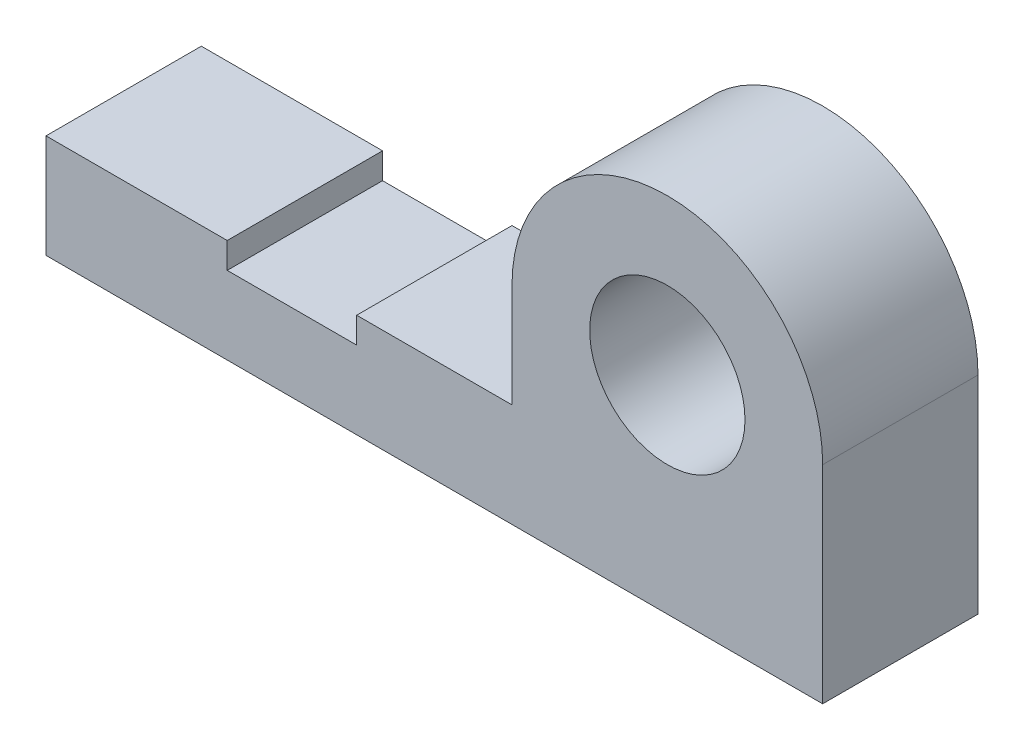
ISO-10303-21;
HEADER;
FILE_DESCRIPTION(('STEP AP214'),'2;1');
FILE_NAME('part.step','',(''),(''),'','','');
FILE_SCHEMA(('AUTOMOTIVE_DESIGN { 1 0 10303 214 1 1 1 1 }'));
ENDSEC;
DATA;
#1=APPLICATION_CONTEXT('core data for automotive mechanical design processes');
#2=APPLICATION_PROTOCOL_DEFINITION('international standard','automotive_design',2000,#1);
#3=PRODUCT_CONTEXT('',#1,'mechanical');
#4=PRODUCT('Part','Part','',(#3));
#5=PRODUCT_RELATED_PRODUCT_CATEGORY('part','',(#4));
#6=PRODUCT_DEFINITION_FORMATION('','',#4);
#7=PRODUCT_DEFINITION_CONTEXT('part definition',#1,'design');
#8=PRODUCT_DEFINITION('design','',#6,#7);
#9=PRODUCT_DEFINITION_SHAPE('','',#8);
#10=(LENGTH_UNIT() NAMED_UNIT(*) SI_UNIT(.MILLI.,.METRE.));
#11=(NAMED_UNIT(*) PLANE_ANGLE_UNIT() SI_UNIT($,.RADIAN.));
#12=(NAMED_UNIT(*) SI_UNIT($,.STERADIAN.) SOLID_ANGLE_UNIT());
#13=UNCERTAINTY_MEASURE_WITH_UNIT(LENGTH_MEASURE(1.E-05),#10,'distance_accuracy_value','');
#14=(GEOMETRIC_REPRESENTATION_CONTEXT(3) GLOBAL_UNCERTAINTY_ASSIGNED_CONTEXT((#13)) GLOBAL_UNIT_ASSIGNED_CONTEXT((#10,
#11,#12)) REPRESENTATION_CONTEXT('',''));
#15=CARTESIAN_POINT('',(0.,0.,0.));
#16=DIRECTION('',(0.,0.,1.));
#17=DIRECTION('',(1.,0.,0.));
#18=AXIS2_PLACEMENT_3D('',#15,#16,#17);
#19=CARTESIAN_POINT('',(120.,40.,30.));
#20=DIRECTION('',(0.,0.,1.));
#21=DIRECTION('',(1.,0.,0.));
#22=AXIS2_PLACEMENT_3D('',#19,#20,#21);
#23=PLANE('',#22);
#24=DIRECTION('',(0.,1.,0.));
#25=VECTOR('',#24,1.);
#26=CARTESIAN_POINT('',(150.,0.,30.));
#27=LINE('',#26,#25);
#28=CARTESIAN_POINT('',(150.,0.,30.));
#29=VERTEX_POINT('',#28);
#30=CARTESIAN_POINT('',(150.,40.,30.));
#31=VERTEX_POINT('',#30);
#32=EDGE_CURVE('E200',#29,#31,#27,.T.);
#33=ORIENTED_EDGE('',*,*,#32,.T.);
#34=CARTESIAN_POINT('',(120.,40.,30.));
#35=DIRECTION('',(0.,0.,1.));
#36=DIRECTION('',(1.,0.,0.));
#37=AXIS2_PLACEMENT_3D('',#34,#35,#36);
#38=CIRCLE('',#37,30.);
#39=CARTESIAN_POINT('',(90.,40.,30.));
#40=VERTEX_POINT('',#39);
#41=EDGE_CURVE('E138',#31,#40,#38,.T.);
#42=ORIENTED_EDGE('',*,*,#41,.T.);
#43=DIRECTION('',(0.,-1.,0.));
#44=VECTOR('',#43,1.);
#45=CARTESIAN_POINT('',(90.,40.,30.));
#46=LINE('',#45,#44);
#47=CARTESIAN_POINT('',(90.,20.,30.));
#48=VERTEX_POINT('',#47);
#49=EDGE_CURVE('E221',#40,#48,#46,.T.);
#50=ORIENTED_EDGE('',*,*,#49,.T.);
#51=DIRECTION('',(-1.,0.,0.));
#52=VECTOR('',#51,1.);
#53=CARTESIAN_POINT('',(90.,20.,30.));
#54=LINE('',#53,#52);
#55=CARTESIAN_POINT('',(60.,20.,30.));
#56=VERTEX_POINT('',#55);
#57=EDGE_CURVE('E240',#48,#56,#54,.T.);
#58=ORIENTED_EDGE('',*,*,#57,.T.);
#59=DIRECTION('',(0.,-1.,0.));
#60=VECTOR('',#59,1.);
#61=CARTESIAN_POINT('',(60.,20.,30.));
#62=LINE('',#61,#60);
#63=CARTESIAN_POINT('',(60.,15.,30.));
#64=VERTEX_POINT('',#63);
#65=EDGE_CURVE('E237',#56,#64,#62,.T.);
#66=ORIENTED_EDGE('',*,*,#65,.T.);
#67=DIRECTION('',(-1.,0.,0.));
#68=VECTOR('',#67,1.);
#69=CARTESIAN_POINT('',(60.,15.,30.));
#70=LINE('',#69,#68);
#71=CARTESIAN_POINT('',(35.,15.,30.));
#72=VERTEX_POINT('',#71);
#73=EDGE_CURVE('E239',#64,#72,#70,.T.);
#74=ORIENTED_EDGE('',*,*,#73,.T.);
#75=DIRECTION('',(0.,1.,0.));
#76=VECTOR('',#75,1.);
#77=CARTESIAN_POINT('',(35.,15.,30.));
#78=LINE('',#77,#76);
#79=CARTESIAN_POINT('',(35.,20.,30.));
#80=VERTEX_POINT('',#79);
#81=EDGE_CURVE('E163',#72,#80,#78,.T.);
#82=ORIENTED_EDGE('',*,*,#81,.T.);
#83=DIRECTION('',(-1.,0.,0.));
#84=VECTOR('',#83,1.);
#85=CARTESIAN_POINT('',(35.,20.,30.));
#86=LINE('',#85,#84);
#87=CARTESIAN_POINT('',(0.,20.,30.));
#88=VERTEX_POINT('',#87);
#89=EDGE_CURVE('E157',#80,#88,#86,.T.);
#90=ORIENTED_EDGE('',*,*,#89,.T.);
#91=DIRECTION('',(0.,-1.,0.));
#92=VECTOR('',#91,1.);
#93=CARTESIAN_POINT('',(0.,20.,30.));
#94=LINE('',#93,#92);
#95=CARTESIAN_POINT('',(0.,0.,30.));
#96=VERTEX_POINT('',#95);
#97=EDGE_CURVE('E161',#88,#96,#94,.T.);
#98=ORIENTED_EDGE('',*,*,#97,.T.);
#99=DIRECTION('',(1.,0.,0.));
#100=VECTOR('',#99,1.);
#101=CARTESIAN_POINT('',(0.,0.,30.));
#102=LINE('',#101,#100);
#103=EDGE_CURVE('E89',#96,#29,#102,.T.);
#104=ORIENTED_EDGE('',*,*,#103,.T.);
#105=EDGE_LOOP('',(#33,#42,#50,#58,#66,#74,#82,#90,#98,#104));
#106=FACE_BOUND('',#105,.T.);
#107=CARTESIAN_POINT('',(120.,40.,30.));
#108=DIRECTION('',(0.,0.,1.));
#109=DIRECTION('',(1.,0.,0.));
#110=AXIS2_PLACEMENT_3D('',#107,#108,#109);
#111=CIRCLE('',#110,15.);
#112=CARTESIAN_POINT('',(135.,40.,30.));
#113=VERTEX_POINT('',#112);
#114=EDGE_CURVE('E185',#113,#113,#111,.T.);
#115=ORIENTED_EDGE('',*,*,#114,.F.);
#116=EDGE_LOOP('',(#115));
#117=FACE_BOUND('',#116,.T.);
#118=ADVANCED_FACE('F72',(#106,#117),#23,.T.);
#119=CARTESIAN_POINT('',(120.,40.,0.));
#120=DIRECTION('',(0.,0.,1.));
#121=DIRECTION('',(1.,0.,0.));
#122=AXIS2_PLACEMENT_3D('',#119,#120,#121);
#123=PLANE('',#122);
#124=DIRECTION('',(0.,1.,0.));
#125=VECTOR('',#124,1.);
#126=CARTESIAN_POINT('',(150.,0.,0.));
#127=LINE('',#126,#125);
#128=CARTESIAN_POINT('',(150.,0.,0.));
#129=VERTEX_POINT('',#128);
#130=CARTESIAN_POINT('',(150.,40.,0.));
#131=VERTEX_POINT('',#130);
#132=EDGE_CURVE('E181',#129,#131,#127,.T.);
#133=ORIENTED_EDGE('',*,*,#132,.F.);
#134=DIRECTION('',(1.,0.,0.));
#135=VECTOR('',#134,1.);
#136=CARTESIAN_POINT('',(0.,0.,0.));
#137=LINE('',#136,#135);
#138=CARTESIAN_POINT('',(0.,0.,0.));
#139=VERTEX_POINT('',#138);
#140=EDGE_CURVE('E130',#139,#129,#137,.T.);
#141=ORIENTED_EDGE('',*,*,#140,.F.);
#142=DIRECTION('',(0.,-1.,0.));
#143=VECTOR('',#142,1.);
#144=CARTESIAN_POINT('',(0.,20.,0.));
#145=LINE('',#144,#143);
#146=CARTESIAN_POINT('',(0.,20.,0.));
#147=VERTEX_POINT('',#146);
#148=EDGE_CURVE('E124',#147,#139,#145,.T.);
#149=ORIENTED_EDGE('',*,*,#148,.F.);
#150=DIRECTION('',(-1.,0.,0.));
#151=VECTOR('',#150,1.);
#152=CARTESIAN_POINT('',(35.,20.,0.));
#153=LINE('',#152,#151);
#154=CARTESIAN_POINT('',(35.,20.,0.));
#155=VERTEX_POINT('',#154);
#156=EDGE_CURVE('E171',#155,#147,#153,.T.);
#157=ORIENTED_EDGE('',*,*,#156,.F.);
#158=DIRECTION('',(0.,1.,0.));
#159=VECTOR('',#158,1.);
#160=CARTESIAN_POINT('',(35.,15.,0.));
#161=LINE('',#160,#159);
#162=CARTESIAN_POINT('',(35.,15.,0.));
#163=VERTEX_POINT('',#162);
#164=EDGE_CURVE('E195',#163,#155,#161,.T.);
#165=ORIENTED_EDGE('',*,*,#164,.F.);
#166=DIRECTION('',(-1.,0.,0.));
#167=VECTOR('',#166,1.);
#168=CARTESIAN_POINT('',(60.,15.,0.));
#169=LINE('',#168,#167);
#170=CARTESIAN_POINT('',(60.,15.,0.));
#171=VERTEX_POINT('',#170);
#172=EDGE_CURVE('E193',#171,#163,#169,.T.);
#173=ORIENTED_EDGE('',*,*,#172,.F.);
#174=DIRECTION('',(0.,-1.,0.));
#175=VECTOR('',#174,1.);
#176=CARTESIAN_POINT('',(60.,20.,0.));
#177=LINE('',#176,#175);
#178=CARTESIAN_POINT('',(60.,20.,0.));
#179=VERTEX_POINT('',#178);
#180=EDGE_CURVE('E191',#179,#171,#177,.T.);
#181=ORIENTED_EDGE('',*,*,#180,.F.);
#182=DIRECTION('',(-1.,0.,0.));
#183=VECTOR('',#182,1.);
#184=CARTESIAN_POINT('',(90.,20.,0.));
#185=LINE('',#184,#183);
#186=CARTESIAN_POINT('',(90.,20.,0.));
#187=VERTEX_POINT('',#186);
#188=EDGE_CURVE('E189',#187,#179,#185,.T.);
#189=ORIENTED_EDGE('',*,*,#188,.F.);
#190=DIRECTION('',(0.,-1.,0.));
#191=VECTOR('',#190,1.);
#192=CARTESIAN_POINT('',(90.,40.,0.));
#193=LINE('',#192,#191);
#194=CARTESIAN_POINT('',(90.,40.,0.));
#195=VERTEX_POINT('',#194);
#196=EDGE_CURVE('E187',#195,#187,#193,.T.);
#197=ORIENTED_EDGE('',*,*,#196,.F.);
#198=CARTESIAN_POINT('',(120.,40.,0.));
#199=DIRECTION('',(0.,0.,1.));
#200=DIRECTION('',(1.,0.,0.));
#201=AXIS2_PLACEMENT_3D('',#198,#199,#200);
#202=CIRCLE('',#201,30.);
#203=EDGE_CURVE('E184',#131,#195,#202,.T.);
#204=ORIENTED_EDGE('',*,*,#203,.F.);
#205=EDGE_LOOP('',(#133,#141,#149,#157,#165,#173,#181,#189,#197,#204));
#206=FACE_BOUND('',#205,.T.);
#207=CARTESIAN_POINT('',(120.,40.,0.));
#208=DIRECTION('',(0.,0.,1.));
#209=DIRECTION('',(1.,0.,0.));
#210=AXIS2_PLACEMENT_3D('',#207,#208,#209);
#211=CIRCLE('',#210,15.);
#212=CARTESIAN_POINT('',(135.,40.,0.));
#213=VERTEX_POINT('',#212);
#214=EDGE_CURVE('E248',#213,#213,#211,.T.);
#215=ORIENTED_EDGE('',*,*,#214,.T.);
#216=EDGE_LOOP('',(#215));
#217=FACE_BOUND('',#216,.T.);
#218=ADVANCED_FACE('F225',(#206,#217),#123,.F.);
#219=CARTESIAN_POINT('',(150.,0.,30.));
#220=DIRECTION('',(-1.,0.,0.));
#221=DIRECTION('',(0.,-1.,0.));
#222=AXIS2_PLACEMENT_3D('',#219,#220,#221);
#223=PLANE('',#222);
#224=ORIENTED_EDGE('',*,*,#132,.T.);
#225=DIRECTION('',(0.,0.,-1.));
#226=VECTOR('',#225,1.);
#227=CARTESIAN_POINT('',(150.,40.,30.));
#228=LINE('',#227,#226);
#229=EDGE_CURVE('E12',#31,#131,#228,.T.);
#230=ORIENTED_EDGE('',*,*,#229,.F.);
#231=ORIENTED_EDGE('',*,*,#32,.F.);
#232=DIRECTION('',(0.,0.,-1.));
#233=VECTOR('',#232,1.);
#234=CARTESIAN_POINT('',(150.,0.,30.));
#235=LINE('',#234,#233);
#236=EDGE_CURVE('E177',#29,#129,#235,.T.);
#237=ORIENTED_EDGE('',*,*,#236,.T.);
#238=EDGE_LOOP('',(#224,#230,#231,#237));
#239=FACE_BOUND('',#238,.T.);
#240=ADVANCED_FACE('F74',(#239),#223,.F.);
#241=CARTESIAN_POINT('',(120.,40.,30.));
#242=DIRECTION('',(0.,0.,-1.));
#243=DIRECTION('',(-1.,0.,0.));
#244=AXIS2_PLACEMENT_3D('',#241,#242,#243);
#245=CYLINDRICAL_SURFACE('',#244,30.);
#246=ORIENTED_EDGE('',*,*,#203,.T.);
#247=DIRECTION('',(0.,0.,-1.));
#248=VECTOR('',#247,1.);
#249=CARTESIAN_POINT('',(90.,40.,30.));
#250=LINE('',#249,#248);
#251=EDGE_CURVE('E81',#40,#195,#250,.T.);
#252=ORIENTED_EDGE('',*,*,#251,.F.);
#253=ORIENTED_EDGE('',*,*,#41,.F.);
#254=ORIENTED_EDGE('',*,*,#229,.T.);
#255=EDGE_LOOP('',(#246,#252,#253,#254));
#256=FACE_BOUND('',#255,.T.);
#257=ADVANCED_FACE('F284',(#256),#245,.T.);
#258=CARTESIAN_POINT('',(90.,40.,30.));
#259=DIRECTION('',(1.,0.,0.));
#260=DIRECTION('',(0.,0.,-1.));
#261=AXIS2_PLACEMENT_3D('',#258,#259,#260);
#262=PLANE('',#261);
#263=ORIENTED_EDGE('',*,*,#196,.T.);
#264=DIRECTION('',(0.,0.,-1.));
#265=VECTOR('',#264,1.);
#266=CARTESIAN_POINT('',(90.,20.,30.));
#267=LINE('',#266,#265);
#268=EDGE_CURVE('E213',#48,#187,#267,.T.);
#269=ORIENTED_EDGE('',*,*,#268,.F.);
#270=ORIENTED_EDGE('',*,*,#49,.F.);
#271=ORIENTED_EDGE('',*,*,#251,.T.);
#272=EDGE_LOOP('',(#263,#269,#270,#271));
#273=FACE_BOUND('',#272,.T.);
#274=ADVANCED_FACE('F219',(#273),#262,.F.);
#275=CARTESIAN_POINT('',(90.,20.,30.));
#276=DIRECTION('',(0.,-1.,0.));
#277=DIRECTION('',(1.,0.,0.));
#278=AXIS2_PLACEMENT_3D('',#275,#276,#277);
#279=PLANE('',#278);
#280=ORIENTED_EDGE('',*,*,#188,.T.);
#281=DIRECTION('',(0.,0.,-1.));
#282=VECTOR('',#281,1.);
#283=CARTESIAN_POINT('',(60.,20.,30.));
#284=LINE('',#283,#282);
#285=EDGE_CURVE('E210',#56,#179,#284,.T.);
#286=ORIENTED_EDGE('',*,*,#285,.F.);
#287=ORIENTED_EDGE('',*,*,#57,.F.);
#288=ORIENTED_EDGE('',*,*,#268,.T.);
#289=EDGE_LOOP('',(#280,#286,#287,#288));
#290=FACE_BOUND('',#289,.T.);
#291=ADVANCED_FACE('F231',(#290),#279,.F.);
#292=CARTESIAN_POINT('',(60.,20.,30.));
#293=DIRECTION('',(1.,0.,0.));
#294=DIRECTION('',(0.,0.,-1.));
#295=AXIS2_PLACEMENT_3D('',#292,#293,#294);
#296=PLANE('',#295);
#297=ORIENTED_EDGE('',*,*,#180,.T.);
#298=DIRECTION('',(0.,0.,-1.));
#299=VECTOR('',#298,1.);
#300=CARTESIAN_POINT('',(60.,15.,30.));
#301=LINE('',#300,#299);
#302=EDGE_CURVE('E207',#64,#171,#301,.T.);
#303=ORIENTED_EDGE('',*,*,#302,.F.);
#304=ORIENTED_EDGE('',*,*,#65,.F.);
#305=ORIENTED_EDGE('',*,*,#285,.T.);
#306=EDGE_LOOP('',(#297,#303,#304,#305));
#307=FACE_BOUND('',#306,.T.);
#308=ADVANCED_FACE('F235',(#307),#296,.F.);
#309=CARTESIAN_POINT('',(60.,15.,30.));
#310=DIRECTION('',(0.,-1.,0.));
#311=DIRECTION('',(1.,0.,0.));
#312=AXIS2_PLACEMENT_3D('',#309,#310,#311);
#313=PLANE('',#312);
#314=ORIENTED_EDGE('',*,*,#172,.T.);
#315=DIRECTION('',(0.,0.,-1.));
#316=VECTOR('',#315,1.);
#317=CARTESIAN_POINT('',(35.,15.,30.));
#318=LINE('',#317,#316);
#319=EDGE_CURVE('E204',#72,#163,#318,.T.);
#320=ORIENTED_EDGE('',*,*,#319,.F.);
#321=ORIENTED_EDGE('',*,*,#73,.F.);
#322=ORIENTED_EDGE('',*,*,#302,.T.);
#323=EDGE_LOOP('',(#314,#320,#321,#322));
#324=FACE_BOUND('',#323,.T.);
#325=ADVANCED_FACE('F274',(#324),#313,.F.);
#326=CARTESIAN_POINT('',(35.,15.,30.));
#327=DIRECTION('',(-1.,0.,0.));
#328=DIRECTION('',(0.,0.,1.));
#329=AXIS2_PLACEMENT_3D('',#326,#327,#328);
#330=PLANE('',#329);
#331=ORIENTED_EDGE('',*,*,#164,.T.);
#332=DIRECTION('',(0.,0.,-1.));
#333=VECTOR('',#332,1.);
#334=CARTESIAN_POINT('',(35.,20.,30.));
#335=LINE('',#334,#333);
#336=EDGE_CURVE('E172',#80,#155,#335,.T.);
#337=ORIENTED_EDGE('',*,*,#336,.F.);
#338=ORIENTED_EDGE('',*,*,#81,.F.);
#339=ORIENTED_EDGE('',*,*,#319,.T.);
#340=EDGE_LOOP('',(#331,#337,#338,#339));
#341=FACE_BOUND('',#340,.T.);
#342=ADVANCED_FACE('F271',(#341),#330,.F.);
#343=CARTESIAN_POINT('',(35.,20.,30.));
#344=DIRECTION('',(0.,-1.,0.));
#345=DIRECTION('',(1.,0.,0.));
#346=AXIS2_PLACEMENT_3D('',#343,#344,#345);
#347=PLANE('',#346);
#348=ORIENTED_EDGE('',*,*,#156,.T.);
#349=DIRECTION('',(0.,0.,-1.));
#350=VECTOR('',#349,1.);
#351=CARTESIAN_POINT('',(0.,20.,30.));
#352=LINE('',#351,#350);
#353=EDGE_CURVE('E168',#88,#147,#352,.T.);
#354=ORIENTED_EDGE('',*,*,#353,.F.);
#355=ORIENTED_EDGE('',*,*,#89,.F.);
#356=ORIENTED_EDGE('',*,*,#336,.T.);
#357=EDGE_LOOP('',(#348,#354,#355,#356));
#358=FACE_BOUND('',#357,.T.);
#359=ADVANCED_FACE('F169',(#358),#347,.F.);
#360=CARTESIAN_POINT('',(0.,20.,30.));
#361=DIRECTION('',(1.,0.,0.));
#362=DIRECTION('',(0.,1.,0.));
#363=AXIS2_PLACEMENT_3D('',#360,#361,#362);
#364=PLANE('',#363);
#365=ORIENTED_EDGE('',*,*,#148,.T.);
#366=DIRECTION('',(0.,0.,-1.));
#367=VECTOR('',#366,1.);
#368=CARTESIAN_POINT('',(0.,0.,30.));
#369=LINE('',#368,#367);
#370=EDGE_CURVE('E173',#96,#139,#369,.T.);
#371=ORIENTED_EDGE('',*,*,#370,.F.);
#372=ORIENTED_EDGE('',*,*,#97,.F.);
#373=ORIENTED_EDGE('',*,*,#353,.T.);
#374=EDGE_LOOP('',(#365,#371,#372,#373));
#375=FACE_BOUND('',#374,.T.);
#376=ADVANCED_FACE('F175',(#375),#364,.F.);
#377=CARTESIAN_POINT('',(0.,0.,30.));
#378=DIRECTION('',(0.,1.,0.));
#379=DIRECTION('',(0.,0.,1.));
#380=AXIS2_PLACEMENT_3D('',#377,#378,#379);
#381=PLANE('',#380);
#382=ORIENTED_EDGE('',*,*,#140,.T.);
#383=ORIENTED_EDGE('',*,*,#236,.F.);
#384=ORIENTED_EDGE('',*,*,#103,.F.);
#385=ORIENTED_EDGE('',*,*,#370,.T.);
#386=EDGE_LOOP('',(#382,#383,#384,#385));
#387=FACE_BOUND('',#386,.T.);
#388=ADVANCED_FACE('F264',(#387),#381,.F.);
#389=CARTESIAN_POINT('',(120.,40.,30.));
#390=DIRECTION('',(0.,0.,-1.));
#391=DIRECTION('',(-1.,0.,0.));
#392=AXIS2_PLACEMENT_3D('',#389,#390,#391);
#393=CYLINDRICAL_SURFACE('',#392,15.);
#394=ORIENTED_EDGE('',*,*,#114,.T.);
#395=EDGE_LOOP('',(#394));
#396=FACE_BOUND('',#395,.T.);
#397=ORIENTED_EDGE('',*,*,#214,.F.);
#398=EDGE_LOOP('',(#397));
#399=FACE_BOUND('',#398,.T.);
#400=ADVANCED_FACE('F254',(#396,#399),#393,.F.);
#401=CLOSED_SHELL('',(#118,#218,#240,#257,#274,#291,#308,#325,#342,#359,#376,#388,#400));
#402=MANIFOLD_SOLID_BREP('B2',#401);
#403=ADVANCED_BREP_SHAPE_REPRESENTATION('',(#18,#402),#14);
#404=SHAPE_DEFINITION_REPRESENTATION(#9,#403);
ENDSEC;
END-ISO-10303-21;
